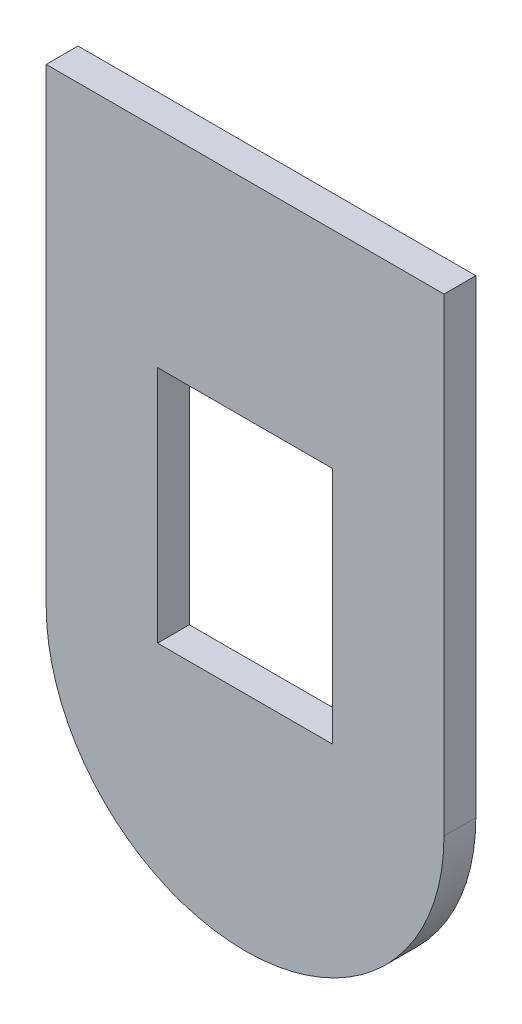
ISO-10303-21;
HEADER;
FILE_DESCRIPTION(('STEP AP214'),'2;1');
FILE_NAME('part.step','',(''),(''),'','','');
FILE_SCHEMA(('AUTOMOTIVE_DESIGN { 1 0 10303 214 1 1 1 1 }'));
ENDSEC;
DATA;
#1=APPLICATION_CONTEXT('core data for automotive mechanical design processes');
#2=APPLICATION_PROTOCOL_DEFINITION('international standard','automotive_design',2000,#1);
#3=PRODUCT_CONTEXT('',#1,'mechanical');
#4=PRODUCT('Part','Part','',(#3));
#5=PRODUCT_RELATED_PRODUCT_CATEGORY('part','',(#4));
#6=PRODUCT_DEFINITION_FORMATION('','',#4);
#7=PRODUCT_DEFINITION_CONTEXT('part definition',#1,'design');
#8=PRODUCT_DEFINITION('design','',#6,#7);
#9=PRODUCT_DEFINITION_SHAPE('','',#8);
#10=(LENGTH_UNIT() NAMED_UNIT(*) SI_UNIT(.MILLI.,.METRE.));
#11=(NAMED_UNIT(*) PLANE_ANGLE_UNIT() SI_UNIT($,.RADIAN.));
#12=(NAMED_UNIT(*) SI_UNIT($,.STERADIAN.) SOLID_ANGLE_UNIT());
#13=UNCERTAINTY_MEASURE_WITH_UNIT(LENGTH_MEASURE(1.E-05),#10,'distance_accuracy_value','');
#14=(GEOMETRIC_REPRESENTATION_CONTEXT(3) GLOBAL_UNCERTAINTY_ASSIGNED_CONTEXT((#13)) GLOBAL_UNIT_ASSIGNED_CONTEXT((#10,
#11,#12)) REPRESENTATION_CONTEXT('',''));
#15=CARTESIAN_POINT('',(0.,0.,0.));
#16=DIRECTION('',(0.,0.,1.));
#17=DIRECTION('',(1.,0.,0.));
#18=AXIS2_PLACEMENT_3D('',#15,#16,#17);
#19=CARTESIAN_POINT('',(0.,-30.5,2.));
#20=DIRECTION('',(0.,0.,-1.));
#21=DIRECTION('',(-1.,0.,0.));
#22=AXIS2_PLACEMENT_3D('',#19,#20,#21);
#23=PLANE('',#22);
#24=DIRECTION('',(-1.,0.,0.));
#25=VECTOR('',#24,1.);
#26=CARTESIAN_POINT('',(-12.5,-1.,2.));
#27=LINE('',#26,#25);
#28=CARTESIAN_POINT('',(12.5,-1.,2.));
#29=VERTEX_POINT('',#28);
#30=CARTESIAN_POINT('',(-12.5,-1.,2.));
#31=VERTEX_POINT('',#30);
#32=EDGE_CURVE('E142',#29,#31,#27,.T.);
#33=ORIENTED_EDGE('',*,*,#32,.T.);
#34=DIRECTION('',(0.,-1.,0.));
#35=VECTOR('',#34,1.);
#36=CARTESIAN_POINT('',(-12.5,-1.,2.));
#37=LINE('',#36,#35);
#38=CARTESIAN_POINT('',(-12.5,-30.5,2.));
#39=VERTEX_POINT('',#38);
#40=EDGE_CURVE('E145',#31,#39,#37,.T.);
#41=ORIENTED_EDGE('',*,*,#40,.T.);
#42=CARTESIAN_POINT('',(0.,-30.5,2.));
#43=DIRECTION('',(0.,0.,1.));
#44=DIRECTION('',(-1.,0.,0.));
#45=AXIS2_PLACEMENT_3D('',#42,#43,#44);
#46=CIRCLE('',#45,12.5);
#47=CARTESIAN_POINT('',(12.5,-30.5,2.));
#48=VERTEX_POINT('',#47);
#49=EDGE_CURVE('E147',#39,#48,#46,.T.);
#50=ORIENTED_EDGE('',*,*,#49,.T.);
#51=DIRECTION('',(0.,1.,0.));
#52=VECTOR('',#51,1.);
#53=CARTESIAN_POINT('',(12.5,-1.,2.));
#54=LINE('',#53,#52);
#55=EDGE_CURVE('E149',#48,#29,#54,.T.);
#56=ORIENTED_EDGE('',*,*,#55,.T.);
#57=EDGE_LOOP('',(#33,#41,#50,#56));
#58=FACE_BOUND('',#57,.T.);
#59=DIRECTION('',(0.,-1.,0.));
#60=VECTOR('',#59,1.);
#61=CARTESIAN_POINT('',(-5.5,-14.,2.));
#62=LINE('',#61,#60);
#63=CARTESIAN_POINT('',(-5.5,-14.,2.));
#64=VERTEX_POINT('',#63);
#65=CARTESIAN_POINT('',(-5.5,-29.,2.));
#66=VERTEX_POINT('',#65);
#67=EDGE_CURVE('E113',#64,#66,#62,.T.);
#68=ORIENTED_EDGE('',*,*,#67,.F.);
#69=DIRECTION('',(-1.,0.,0.));
#70=VECTOR('',#69,1.);
#71=CARTESIAN_POINT('',(-5.5,-14.,2.));
#72=LINE('',#71,#70);
#73=CARTESIAN_POINT('',(5.5,-14.,2.));
#74=VERTEX_POINT('',#73);
#75=EDGE_CURVE('E128',#74,#64,#72,.T.);
#76=ORIENTED_EDGE('',*,*,#75,.F.);
#77=DIRECTION('',(0.,1.,0.));
#78=VECTOR('',#77,1.);
#79=CARTESIAN_POINT('',(5.5,-14.,2.));
#80=LINE('',#79,#78);
#81=CARTESIAN_POINT('',(5.5,-29.,2.));
#82=VERTEX_POINT('',#81);
#83=EDGE_CURVE('E126',#82,#74,#80,.T.);
#84=ORIENTED_EDGE('',*,*,#83,.F.);
#85=DIRECTION('',(1.,0.,0.));
#86=VECTOR('',#85,1.);
#87=CARTESIAN_POINT('',(-5.5,-29.,2.));
#88=LINE('',#87,#86);
#89=EDGE_CURVE('E124',#66,#82,#88,.T.);
#90=ORIENTED_EDGE('',*,*,#89,.F.);
#91=EDGE_LOOP('',(#68,#76,#84,#90));
#92=FACE_BOUND('',#91,.T.);
#93=ADVANCED_FACE('F33',(#58,#92),#23,.F.);
#94=CARTESIAN_POINT('',(0.,-30.5,0.));
#95=DIRECTION('',(0.,0.,-1.));
#96=DIRECTION('',(-1.,0.,0.));
#97=AXIS2_PLACEMENT_3D('',#94,#95,#96);
#98=PLANE('',#97);
#99=DIRECTION('',(-1.,0.,0.));
#100=VECTOR('',#99,1.);
#101=CARTESIAN_POINT('',(-12.5,-1.,0.));
#102=LINE('',#101,#100);
#103=CARTESIAN_POINT('',(12.5,-1.,0.));
#104=VERTEX_POINT('',#103);
#105=CARTESIAN_POINT('',(-12.5,-1.,0.));
#106=VERTEX_POINT('',#105);
#107=EDGE_CURVE('E114',#104,#106,#102,.T.);
#108=ORIENTED_EDGE('',*,*,#107,.F.);
#109=DIRECTION('',(0.,1.,0.));
#110=VECTOR('',#109,1.);
#111=CARTESIAN_POINT('',(12.5,-1.,0.));
#112=LINE('',#111,#110);
#113=CARTESIAN_POINT('',(12.5,-30.5,0.));
#114=VERTEX_POINT('',#113);
#115=EDGE_CURVE('E140',#114,#104,#112,.T.);
#116=ORIENTED_EDGE('',*,*,#115,.F.);
#117=CARTESIAN_POINT('',(0.,-30.5,0.));
#118=DIRECTION('',(0.,0.,1.));
#119=DIRECTION('',(-1.,0.,0.));
#120=AXIS2_PLACEMENT_3D('',#117,#118,#119);
#121=CIRCLE('',#120,12.5);
#122=CARTESIAN_POINT('',(-12.5,-30.5,0.));
#123=VERTEX_POINT('',#122);
#124=EDGE_CURVE('E138',#123,#114,#121,.T.);
#125=ORIENTED_EDGE('',*,*,#124,.F.);
#126=DIRECTION('',(0.,-1.,0.));
#127=VECTOR('',#126,1.);
#128=CARTESIAN_POINT('',(-12.5,-1.,0.));
#129=LINE('',#128,#127);
#130=EDGE_CURVE('E136',#106,#123,#129,.T.);
#131=ORIENTED_EDGE('',*,*,#130,.F.);
#132=EDGE_LOOP('',(#108,#116,#125,#131));
#133=FACE_BOUND('',#132,.T.);
#134=DIRECTION('',(-1.,0.,0.));
#135=VECTOR('',#134,1.);
#136=CARTESIAN_POINT('',(-5.5,-14.,0.));
#137=LINE('',#136,#135);
#138=CARTESIAN_POINT('',(5.5,-14.,0.));
#139=VERTEX_POINT('',#138);
#140=CARTESIAN_POINT('',(-5.5,-14.,0.));
#141=VERTEX_POINT('',#140);
#142=EDGE_CURVE('E118',#139,#141,#137,.T.);
#143=ORIENTED_EDGE('',*,*,#142,.T.);
#144=DIRECTION('',(0.,-1.,0.));
#145=VECTOR('',#144,1.);
#146=CARTESIAN_POINT('',(-5.5,-14.,0.));
#147=LINE('',#146,#145);
#148=CARTESIAN_POINT('',(-5.5,-29.,0.));
#149=VERTEX_POINT('',#148);
#150=EDGE_CURVE('E56',#141,#149,#147,.T.);
#151=ORIENTED_EDGE('',*,*,#150,.T.);
#152=DIRECTION('',(1.,0.,0.));
#153=VECTOR('',#152,1.);
#154=CARTESIAN_POINT('',(-5.5,-29.,0.));
#155=LINE('',#154,#153);
#156=CARTESIAN_POINT('',(5.5,-29.,0.));
#157=VERTEX_POINT('',#156);
#158=EDGE_CURVE('E100',#149,#157,#155,.T.);
#159=ORIENTED_EDGE('',*,*,#158,.T.);
#160=DIRECTION('',(0.,1.,0.));
#161=VECTOR('',#160,1.);
#162=CARTESIAN_POINT('',(5.5,-14.,0.));
#163=LINE('',#162,#161);
#164=EDGE_CURVE('E109',#157,#139,#163,.T.);
#165=ORIENTED_EDGE('',*,*,#164,.T.);
#166=EDGE_LOOP('',(#143,#151,#159,#165));
#167=FACE_BOUND('',#166,.T.);
#168=ADVANCED_FACE('F117',(#133,#167),#98,.T.);
#169=CARTESIAN_POINT('',(-12.5,-1.,2.));
#170=DIRECTION('',(0.,-1.,0.));
#171=DIRECTION('',(0.,0.,-1.));
#172=AXIS2_PLACEMENT_3D('',#169,#170,#171);
#173=PLANE('',#172);
#174=ORIENTED_EDGE('',*,*,#107,.T.);
#175=DIRECTION('',(0.,0.,-1.));
#176=VECTOR('',#175,1.);
#177=CARTESIAN_POINT('',(-12.5,-1.,2.));
#178=LINE('',#177,#176);
#179=EDGE_CURVE('E11',#31,#106,#178,.T.);
#180=ORIENTED_EDGE('',*,*,#179,.F.);
#181=ORIENTED_EDGE('',*,*,#32,.F.);
#182=DIRECTION('',(0.,0.,-1.));
#183=VECTOR('',#182,1.);
#184=CARTESIAN_POINT('',(12.5,-1.,2.));
#185=LINE('',#184,#183);
#186=EDGE_CURVE('E151',#29,#104,#185,.T.);
#187=ORIENTED_EDGE('',*,*,#186,.T.);
#188=EDGE_LOOP('',(#174,#180,#181,#187));
#189=FACE_BOUND('',#188,.T.);
#190=ADVANCED_FACE('F35',(#189),#173,.F.);
#191=CARTESIAN_POINT('',(-12.5,-1.,2.));
#192=DIRECTION('',(1.,0.,0.));
#193=DIRECTION('',(0.,0.,-1.));
#194=AXIS2_PLACEMENT_3D('',#191,#192,#193);
#195=PLANE('',#194);
#196=ORIENTED_EDGE('',*,*,#130,.T.);
#197=DIRECTION('',(0.,0.,-1.));
#198=VECTOR('',#197,1.);
#199=CARTESIAN_POINT('',(-12.5,-30.5,2.));
#200=LINE('',#199,#198);
#201=EDGE_CURVE('E41',#39,#123,#200,.T.);
#202=ORIENTED_EDGE('',*,*,#201,.F.);
#203=ORIENTED_EDGE('',*,*,#40,.F.);
#204=ORIENTED_EDGE('',*,*,#179,.T.);
#205=EDGE_LOOP('',(#196,#202,#203,#204));
#206=FACE_BOUND('',#205,.T.);
#207=ADVANCED_FACE('F176',(#206),#195,.F.);
#208=CARTESIAN_POINT('',(0.,-30.5,2.));
#209=DIRECTION('',(0.,0.,-1.));
#210=DIRECTION('',(-1.,0.,0.));
#211=AXIS2_PLACEMENT_3D('',#208,#209,#210);
#212=CYLINDRICAL_SURFACE('',#211,12.5);
#213=ORIENTED_EDGE('',*,*,#124,.T.);
#214=DIRECTION('',(0.,0.,-1.));
#215=VECTOR('',#214,1.);
#216=CARTESIAN_POINT('',(12.5,-30.5,2.));
#217=LINE('',#216,#215);
#218=EDGE_CURVE('E154',#48,#114,#217,.T.);
#219=ORIENTED_EDGE('',*,*,#218,.F.);
#220=ORIENTED_EDGE('',*,*,#49,.F.);
#221=ORIENTED_EDGE('',*,*,#201,.T.);
#222=EDGE_LOOP('',(#213,#219,#220,#221));
#223=FACE_BOUND('',#222,.T.);
#224=ADVANCED_FACE('F161',(#223),#212,.T.);
#225=CARTESIAN_POINT('',(12.5,-1.,2.));
#226=DIRECTION('',(-1.,0.,0.));
#227=DIRECTION('',(0.,-1.,0.));
#228=AXIS2_PLACEMENT_3D('',#225,#226,#227);
#229=PLANE('',#228);
#230=ORIENTED_EDGE('',*,*,#115,.T.);
#231=ORIENTED_EDGE('',*,*,#186,.F.);
#232=ORIENTED_EDGE('',*,*,#55,.F.);
#233=ORIENTED_EDGE('',*,*,#218,.T.);
#234=EDGE_LOOP('',(#230,#231,#232,#233));
#235=FACE_BOUND('',#234,.T.);
#236=ADVANCED_FACE('F169',(#235),#229,.F.);
#237=CARTESIAN_POINT('',(-5.5,-14.,2.));
#238=DIRECTION('',(1.,0.,0.));
#239=DIRECTION('',(0.,1.,0.));
#240=AXIS2_PLACEMENT_3D('',#237,#238,#239);
#241=PLANE('',#240);
#242=ORIENTED_EDGE('',*,*,#150,.F.);
#243=DIRECTION('',(0.,0.,-1.));
#244=VECTOR('',#243,1.);
#245=CARTESIAN_POINT('',(-5.5,-14.,2.));
#246=LINE('',#245,#244);
#247=EDGE_CURVE('E130',#64,#141,#246,.T.);
#248=ORIENTED_EDGE('',*,*,#247,.F.);
#249=ORIENTED_EDGE('',*,*,#67,.T.);
#250=DIRECTION('',(0.,0.,-1.));
#251=VECTOR('',#250,1.);
#252=CARTESIAN_POINT('',(-5.5,-29.,2.));
#253=LINE('',#252,#251);
#254=EDGE_CURVE('E102',#66,#149,#253,.T.);
#255=ORIENTED_EDGE('',*,*,#254,.T.);
#256=EDGE_LOOP('',(#242,#248,#249,#255));
#257=FACE_BOUND('',#256,.T.);
#258=ADVANCED_FACE('F111',(#257),#241,.T.);
#259=CARTESIAN_POINT('',(-5.5,-29.,2.));
#260=DIRECTION('',(0.,1.,0.));
#261=DIRECTION('',(0.,0.,1.));
#262=AXIS2_PLACEMENT_3D('',#259,#260,#261);
#263=PLANE('',#262);
#264=ORIENTED_EDGE('',*,*,#158,.F.);
#265=ORIENTED_EDGE('',*,*,#254,.F.);
#266=ORIENTED_EDGE('',*,*,#89,.T.);
#267=DIRECTION('',(0.,0.,-1.));
#268=VECTOR('',#267,1.);
#269=CARTESIAN_POINT('',(5.5,-29.,2.));
#270=LINE('',#269,#268);
#271=EDGE_CURVE('E105',#82,#157,#270,.T.);
#272=ORIENTED_EDGE('',*,*,#271,.T.);
#273=EDGE_LOOP('',(#264,#265,#266,#272));
#274=FACE_BOUND('',#273,.T.);
#275=ADVANCED_FACE('F101',(#274),#263,.T.);
#276=CARTESIAN_POINT('',(5.5,-14.,2.));
#277=DIRECTION('',(-1.,0.,0.));
#278=DIRECTION('',(0.,-1.,0.));
#279=AXIS2_PLACEMENT_3D('',#276,#277,#278);
#280=PLANE('',#279);
#281=ORIENTED_EDGE('',*,*,#164,.F.);
#282=ORIENTED_EDGE('',*,*,#271,.F.);
#283=ORIENTED_EDGE('',*,*,#83,.T.);
#284=DIRECTION('',(0.,0.,-1.));
#285=VECTOR('',#284,1.);
#286=CARTESIAN_POINT('',(5.5,-14.,2.));
#287=LINE('',#286,#285);
#288=EDGE_CURVE('E48',#74,#139,#287,.T.);
#289=ORIENTED_EDGE('',*,*,#288,.T.);
#290=EDGE_LOOP('',(#281,#282,#283,#289));
#291=FACE_BOUND('',#290,.T.);
#292=ADVANCED_FACE('F198',(#291),#280,.T.);
#293=CARTESIAN_POINT('',(-5.5,-14.,2.));
#294=DIRECTION('',(0.,-1.,0.));
#295=DIRECTION('',(0.,0.,-1.));
#296=AXIS2_PLACEMENT_3D('',#293,#294,#295);
#297=PLANE('',#296);
#298=ORIENTED_EDGE('',*,*,#142,.F.);
#299=ORIENTED_EDGE('',*,*,#288,.F.);
#300=ORIENTED_EDGE('',*,*,#75,.T.);
#301=ORIENTED_EDGE('',*,*,#247,.T.);
#302=EDGE_LOOP('',(#298,#299,#300,#301));
#303=FACE_BOUND('',#302,.T.);
#304=ADVANCED_FACE('F203',(#303),#297,.T.);
#305=CLOSED_SHELL('',(#93,#168,#190,#207,#224,#236,#258,#275,#292,#304));
#306=MANIFOLD_SOLID_BREP('B2',#305);
#307=ADVANCED_BREP_SHAPE_REPRESENTATION('',(#18,#306),#14);
#308=SHAPE_DEFINITION_REPRESENTATION(#9,#307);
ENDSEC;
END-ISO-10303-21;
